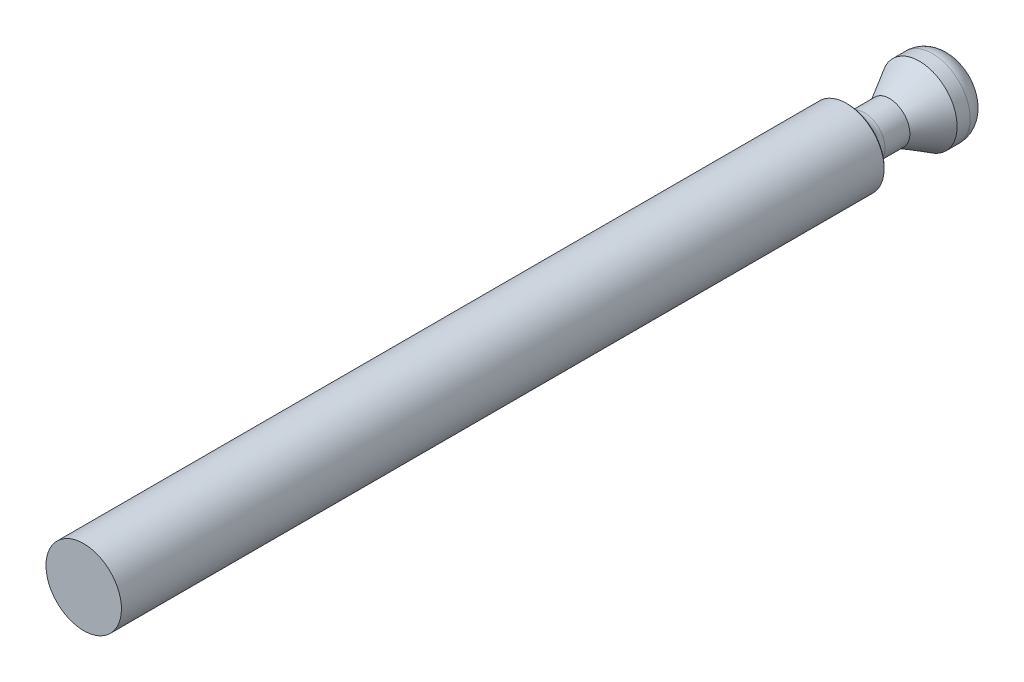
ISO-10303-21;
HEADER;
FILE_DESCRIPTION(('STEP AP214'),'2;1');
FILE_NAME('part.step','',(''),(''),'','','');
FILE_SCHEMA(('AUTOMOTIVE_DESIGN { 1 0 10303 214 1 1 1 1 }'));
ENDSEC;
DATA;
#1=APPLICATION_CONTEXT('core data for automotive mechanical design processes');
#2=APPLICATION_PROTOCOL_DEFINITION('international standard','automotive_design',2000,#1);
#3=PRODUCT_CONTEXT('',#1,'mechanical');
#4=PRODUCT('Part','Part','',(#3));
#5=PRODUCT_RELATED_PRODUCT_CATEGORY('part','',(#4));
#6=PRODUCT_DEFINITION_FORMATION('','',#4);
#7=PRODUCT_DEFINITION_CONTEXT('part definition',#1,'design');
#8=PRODUCT_DEFINITION('design','',#6,#7);
#9=PRODUCT_DEFINITION_SHAPE('','',#8);
#10=(LENGTH_UNIT() NAMED_UNIT(*) SI_UNIT(.MILLI.,.METRE.));
#11=(NAMED_UNIT(*) PLANE_ANGLE_UNIT() SI_UNIT($,.RADIAN.));
#12=(NAMED_UNIT(*) SI_UNIT($,.STERADIAN.) SOLID_ANGLE_UNIT());
#13=UNCERTAINTY_MEASURE_WITH_UNIT(LENGTH_MEASURE(1.E-05),#10,'distance_accuracy_value','');
#14=(GEOMETRIC_REPRESENTATION_CONTEXT(3) GLOBAL_UNCERTAINTY_ASSIGNED_CONTEXT((#13)) GLOBAL_UNIT_ASSIGNED_CONTEXT((#10,
#11,#12)) REPRESENTATION_CONTEXT('',''));
#15=CARTESIAN_POINT('',(0.,0.,0.));
#16=DIRECTION('',(0.,0.,1.));
#17=DIRECTION('',(1.,0.,0.));
#18=AXIS2_PLACEMENT_3D('',#15,#16,#17);
#19=CARTESIAN_POINT('',(0.,0.,0.));
#20=DIRECTION('',(0.,0.,-1.));
#21=DIRECTION('',(0.,1.,0.));
#22=AXIS2_PLACEMENT_3D('',#19,#20,#21);
#23=PLANE('',#22);
#24=CARTESIAN_POINT('',(0.,0.,0.));
#25=DIRECTION('',(0.,0.,-1.));
#26=DIRECTION('',(0.,1.,0.));
#27=AXIS2_PLACEMENT_3D('',#24,#25,#26);
#28=CIRCLE('',#27,6.);
#29=CARTESIAN_POINT('',(0.,6.,0.));
#30=VERTEX_POINT('',#29);
#31=EDGE_CURVE('E34',#30,#30,#28,.F.);
#32=ORIENTED_EDGE('',*,*,#31,.T.);
#33=EDGE_LOOP('',(#32));
#34=FACE_BOUND('',#33,.T.);
#35=ADVANCED_FACE('F14',(#34),#23,.F.);
#36=CARTESIAN_POINT('',(0.,0.,-138.));
#37=DIRECTION('',(0.,0.,-1.));
#38=DIRECTION('',(0.,1.,0.));
#39=AXIS2_PLACEMENT_3D('',#36,#37,#38);
#40=PLANE('',#39);
#41=CARTESIAN_POINT('',(0.,0.,-138.));
#42=DIRECTION('',(0.,0.,-1.));
#43=DIRECTION('',(0.,1.,0.));
#44=AXIS2_PLACEMENT_3D('',#41,#42,#43);
#45=CIRCLE('',#44,1.5);
#46=CARTESIAN_POINT('',(0.,1.5,-138.));
#47=VERTEX_POINT('',#46);
#48=EDGE_CURVE('E37',#47,#47,#45,.T.);
#49=ORIENTED_EDGE('',*,*,#48,.F.);
#50=EDGE_LOOP('',(#49));
#51=FACE_BOUND('',#50,.T.);
#52=CARTESIAN_POINT('',(0.,0.,-138.));
#53=DIRECTION('',(0.,0.,-1.));
#54=DIRECTION('',(0.,1.,0.));
#55=AXIS2_PLACEMENT_3D('',#52,#53,#54);
#56=CIRCLE('',#55,3.);
#57=CARTESIAN_POINT('',(0.,3.,-138.));
#58=VERTEX_POINT('',#57);
#59=EDGE_CURVE('E21',#58,#58,#56,.T.);
#60=ORIENTED_EDGE('',*,*,#59,.T.);
#61=EDGE_LOOP('',(#60));
#62=FACE_BOUND('',#61,.T.);
#63=ADVANCED_FACE('F61',(#51,#62),#40,.T.);
#64=CARTESIAN_POINT('',(0.,0.,-100.));
#65=DIRECTION('',(0.,0.,-1.));
#66=DIRECTION('',(0.,1.,0.));
#67=AXIS2_PLACEMENT_3D('',#64,#65,#66);
#68=CYLINDRICAL_SURFACE('',#67,6.);
#69=CARTESIAN_POINT('',(0.,0.,-135.));
#70=DIRECTION('',(0.,0.,-1.));
#71=DIRECTION('',(0.,1.,0.));
#72=AXIS2_PLACEMENT_3D('',#69,#70,#71);
#73=CIRCLE('',#72,6.);
#74=CARTESIAN_POINT('',(0.,6.,-135.));
#75=VERTEX_POINT('',#74);
#76=EDGE_CURVE('E9',#75,#75,#73,.F.);
#77=ORIENTED_EDGE('',*,*,#76,.T.);
#78=EDGE_LOOP('',(#77));
#79=FACE_BOUND('',#78,.T.);
#80=CARTESIAN_POINT('',(0.,0.,-132.913139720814));
#81=DIRECTION('',(0.,0.,-1.));
#82=DIRECTION('',(0.,1.,0.));
#83=AXIS2_PLACEMENT_3D('',#80,#81,#82);
#84=CIRCLE('',#83,6.);
#85=CARTESIAN_POINT('',(0.,6.,-132.913139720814));
#86=VERTEX_POINT('',#85);
#87=EDGE_CURVE('E47',#86,#86,#84,.T.);
#88=ORIENTED_EDGE('',*,*,#87,.T.);
#89=EDGE_LOOP('',(#88));
#90=FACE_BOUND('',#89,.T.);
#91=ADVANCED_FACE('F85',(#79,#90),#68,.T.);
#92=CARTESIAN_POINT('',(0.,0.,-132.913139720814));
#93=DIRECTION('',(0.,0.,-1.));
#94=DIRECTION('',(0.,1.,0.));
#95=AXIS2_PLACEMENT_3D('',#92,#93,#94);
#96=CONICAL_SURFACE('',#95,6.,0.5235987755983);
#97=CARTESIAN_POINT('',(0.,0.,-128.15));
#98=DIRECTION('',(0.,0.,-1.));
#99=DIRECTION('',(0.,1.,0.));
#100=AXIS2_PLACEMENT_3D('',#97,#98,#99);
#101=CIRCLE('',#100,3.25);
#102=CARTESIAN_POINT('',(0.,3.25,-128.15));
#103=VERTEX_POINT('',#102);
#104=EDGE_CURVE('E44',#103,#103,#101,.T.);
#105=ORIENTED_EDGE('',*,*,#104,.T.);
#106=EDGE_LOOP('',(#105));
#107=FACE_BOUND('',#106,.T.);
#108=ORIENTED_EDGE('',*,*,#87,.F.);
#109=EDGE_LOOP('',(#108));
#110=FACE_BOUND('',#109,.T.);
#111=ADVANCED_FACE('F98',(#107,#110),#96,.T.);
#112=CARTESIAN_POINT('',(0.,0.,-100.));
#113=DIRECTION('',(0.,0.,-1.));
#114=DIRECTION('',(0.,1.,0.));
#115=AXIS2_PLACEMENT_3D('',#112,#113,#114);
#116=CYLINDRICAL_SURFACE('',#115,3.25);
#117=CARTESIAN_POINT('',(0.,0.,-124.195830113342));
#118=DIRECTION('',(0.,0.,1.));
#119=DIRECTION('',(0.,-1.,0.));
#120=AXIS2_PLACEMENT_3D('',#117,#118,#119);
#121=CIRCLE('',#120,3.25);
#122=CARTESIAN_POINT('',(0.,-3.25,-124.195830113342));
#123=VERTEX_POINT('',#122);
#124=EDGE_CURVE('E56',#123,#123,#121,.F.);
#125=ORIENTED_EDGE('',*,*,#124,.T.);
#126=EDGE_LOOP('',(#125));
#127=FACE_BOUND('',#126,.T.);
#128=ORIENTED_EDGE('',*,*,#104,.F.);
#129=EDGE_LOOP('',(#128));
#130=FACE_BOUND('',#129,.T.);
#131=ADVANCED_FACE('F94',(#127,#130),#116,.T.);
#132=CARTESIAN_POINT('',(0.,0.,-100.));
#133=DIRECTION('',(0.,0.,-1.));
#134=DIRECTION('',(0.,1.,0.));
#135=AXIS2_PLACEMENT_3D('',#132,#133,#134);
#136=CYLINDRICAL_SURFACE('',#135,6.);
#137=ORIENTED_EDGE('',*,*,#31,.F.);
#138=EDGE_LOOP('',(#137));
#139=FACE_BOUND('',#138,.T.);
#140=CARTESIAN_POINT('',(0.,0.,-121.3));
#141=DIRECTION('',(0.,0.,-1.));
#142=DIRECTION('',(0.,1.,0.));
#143=AXIS2_PLACEMENT_3D('',#140,#141,#142);
#144=CIRCLE('',#143,6.);
#145=CARTESIAN_POINT('',(0.,6.,-121.3));
#146=VERTEX_POINT('',#145);
#147=EDGE_CURVE('E53',#146,#146,#144,.F.);
#148=ORIENTED_EDGE('',*,*,#147,.T.);
#149=EDGE_LOOP('',(#148));
#150=FACE_BOUND('',#149,.T.);
#151=ADVANCED_FACE('F91',(#139,#150),#136,.T.);
#152=CARTESIAN_POINT('',(0.,0.,-121.5));
#153=DIRECTION('',(0.,0.,1.));
#154=DIRECTION('',(0.,-1.,0.));
#155=AXIS2_PLACEMENT_3D('',#152,#153,#154);
#156=CONICAL_SURFACE('',#155,5.8,0.785398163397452);
#157=ORIENTED_EDGE('',*,*,#147,.F.);
#158=EDGE_LOOP('',(#157));
#159=FACE_BOUND('',#158,.T.);
#160=CARTESIAN_POINT('',(0.,0.,-121.5));
#161=DIRECTION('',(0.,0.,-1.));
#162=DIRECTION('',(0.,1.,0.));
#163=AXIS2_PLACEMENT_3D('',#160,#161,#162);
#164=CIRCLE('',#163,5.8);
#165=CARTESIAN_POINT('',(0.,5.8,-121.5));
#166=VERTEX_POINT('',#165);
#167=EDGE_CURVE('E50',#166,#166,#164,.T.);
#168=ORIENTED_EDGE('',*,*,#167,.F.);
#169=EDGE_LOOP('',(#168));
#170=FACE_BOUND('',#169,.T.);
#171=ADVANCED_FACE('F75',(#159,#170),#156,.T.);
#172=CARTESIAN_POINT('',(0.,0.,-124.195830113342));
#173=DIRECTION('',(0.,0.,1.));
#174=DIRECTION('',(0.,-1.,0.));
#175=AXIS2_PLACEMENT_3D('',#172,#173,#174);
#176=TOROIDAL_SURFACE('',#175,5.95,2.7);
#177=ORIENTED_EDGE('',*,*,#167,.T.);
#178=EDGE_LOOP('',(#177));
#179=FACE_BOUND('',#178,.T.);
#180=ORIENTED_EDGE('',*,*,#124,.F.);
#181=EDGE_LOOP('',(#180));
#182=FACE_BOUND('',#181,.T.);
#183=ADVANCED_FACE('F65',(#179,#182),#176,.F.);
#184=CARTESIAN_POINT('',(0.,0.,-135.));
#185=DIRECTION('',(0.,0.,-1.));
#186=DIRECTION('',(0.,1.,0.));
#187=AXIS2_PLACEMENT_3D('',#184,#185,#186);
#188=DEGENERATE_TOROIDAL_SURFACE('',#187,3.,3.,.T.);
#189=ORIENTED_EDGE('',*,*,#76,.F.);
#190=EDGE_LOOP('',(#189));
#191=FACE_BOUND('',#190,.T.);
#192=ORIENTED_EDGE('',*,*,#59,.F.);
#193=EDGE_LOOP('',(#192));
#194=FACE_BOUND('',#193,.T.);
#195=ADVANCED_FACE('F16',(#191,#194),#188,.T.);
#196=CARTESIAN_POINT('',(0.,0.,-138.));
#197=DIRECTION('',(0.,0.,-1.));
#198=DIRECTION('',(0.,1.,0.));
#199=AXIS2_PLACEMENT_3D('',#196,#197,#198);
#200=CONICAL_SURFACE('',#199,1.5,0.523598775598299);
#201=CARTESIAN_POINT('',(0.,0.,-137.133974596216));
#202=DIRECTION('',(0.,0.,-1.));
#203=DIRECTION('',(0.,1.,0.));
#204=AXIS2_PLACEMENT_3D('',#201,#202,#203);
#205=CIRCLE('',#204,1.);
#206=CARTESIAN_POINT('',(0.,1.,-137.133974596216));
#207=VERTEX_POINT('',#206);
#208=EDGE_CURVE('E33',#207,#207,#205,.T.);
#209=ORIENTED_EDGE('',*,*,#208,.F.);
#210=EDGE_LOOP('',(#209));
#211=FACE_BOUND('',#210,.T.);
#212=ORIENTED_EDGE('',*,*,#48,.T.);
#213=EDGE_LOOP('',(#212));
#214=FACE_BOUND('',#213,.T.);
#215=ADVANCED_FACE('F64',(#211,#214),#200,.F.);
#216=CARTESIAN_POINT('',(0.,0.,-138.));
#217=DIRECTION('',(0.,0.,-1.));
#218=DIRECTION('',(0.,1.,0.));
#219=AXIS2_PLACEMENT_3D('',#216,#217,#218);
#220=CYLINDRICAL_SURFACE('',#219,1.);
#221=CARTESIAN_POINT('',(0.,0.,-134.5));
#222=DIRECTION('',(0.,0.,-1.));
#223=DIRECTION('',(0.,1.,0.));
#224=AXIS2_PLACEMENT_3D('',#221,#222,#223);
#225=CIRCLE('',#224,1.);
#226=CARTESIAN_POINT('',(0.,1.,-134.5));
#227=VERTEX_POINT('',#226);
#228=EDGE_CURVE('E31',#227,#227,#225,.T.);
#229=ORIENTED_EDGE('',*,*,#228,.F.);
#230=EDGE_LOOP('',(#229));
#231=FACE_BOUND('',#230,.T.);
#232=ORIENTED_EDGE('',*,*,#208,.T.);
#233=EDGE_LOOP('',(#232));
#234=FACE_BOUND('',#233,.T.);
#235=ADVANCED_FACE('F27',(#231,#234),#220,.F.);
#236=CARTESIAN_POINT('',(0.,0.,-134.5));
#237=DIRECTION('',(0.,0.,-1.));
#238=DIRECTION('',(0.,1.,0.));
#239=AXIS2_PLACEMENT_3D('',#236,#237,#238);
#240=CONICAL_SURFACE('',#239,1.,1.02974425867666);
#241=CARTESIAN_POINT('',(0.,0.,-133.899139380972));
#242=VERTEX_POINT('',#241);
#243=VERTEX_LOOP('',#242);
#244=FACE_BOUND('',#243,.T.);
#245=ORIENTED_EDGE('',*,*,#228,.T.);
#246=EDGE_LOOP('',(#245));
#247=FACE_BOUND('',#246,.T.);
#248=ADVANCED_FACE('F24',(#244,#247),#240,.F.);
#249=CLOSED_SHELL('',(#35,#63,#91,#111,#131,#151,#171,#183,#195,#215,#235,#248));
#250=MANIFOLD_SOLID_BREP('B1',#249);
#251=ADVANCED_BREP_SHAPE_REPRESENTATION('',(#18,#250),#14);
#252=SHAPE_DEFINITION_REPRESENTATION(#9,#251);
ENDSEC;
END-ISO-10303-21;
